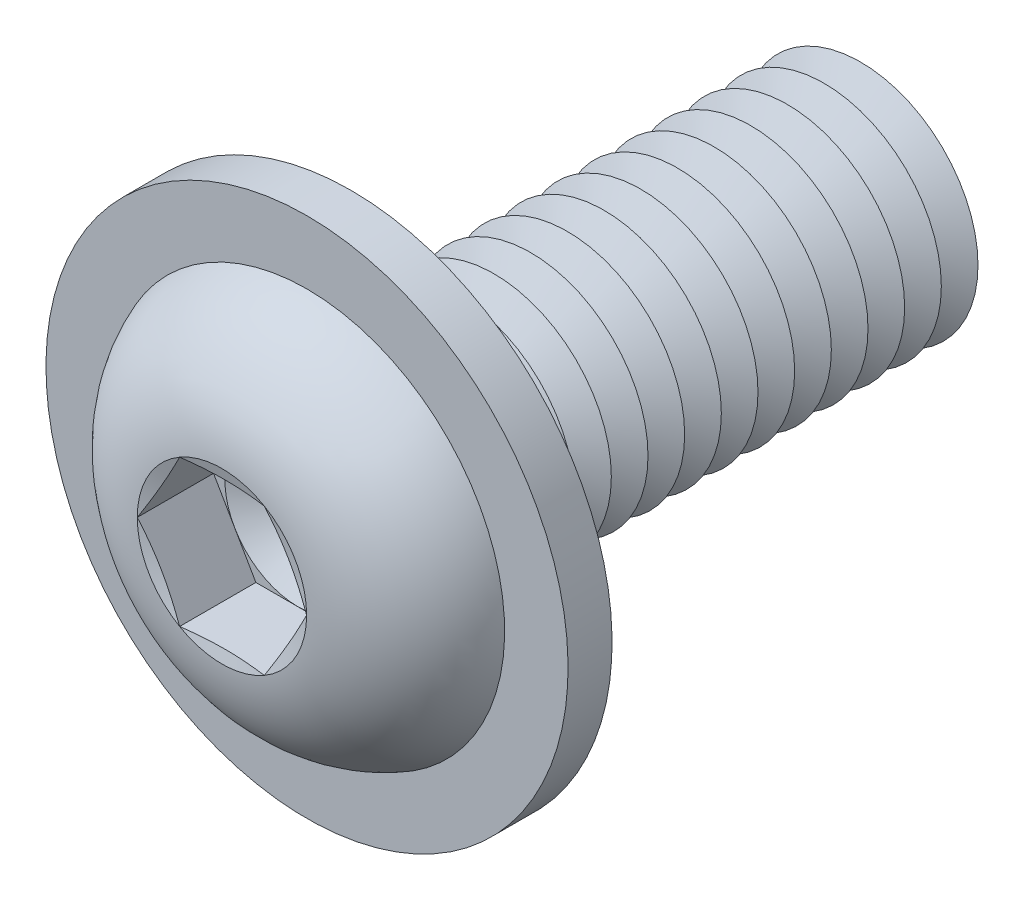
ISO-10303-21;
HEADER;
FILE_DESCRIPTION(('STEP AP214'),'2;1');
FILE_NAME('part.step','',(''),(''),'','','');
FILE_SCHEMA(('AUTOMOTIVE_DESIGN { 1 0 10303 214 1 1 1 1 }'));
ENDSEC;
DATA;
#1=APPLICATION_CONTEXT('core data for automotive mechanical design processes');
#2=APPLICATION_PROTOCOL_DEFINITION('international standard','automotive_design',2000,#1);
#3=PRODUCT_CONTEXT('',#1,'mechanical');
#4=PRODUCT('Part','Part','',(#3));
#5=PRODUCT_RELATED_PRODUCT_CATEGORY('part','',(#4));
#6=PRODUCT_DEFINITION_FORMATION('','',#4);
#7=PRODUCT_DEFINITION_CONTEXT('part definition',#1,'design');
#8=PRODUCT_DEFINITION('design','',#6,#7);
#9=PRODUCT_DEFINITION_SHAPE('','',#8);
#10=(LENGTH_UNIT() NAMED_UNIT(*) SI_UNIT(.MILLI.,.METRE.));
#11=(NAMED_UNIT(*) PLANE_ANGLE_UNIT() SI_UNIT($,.RADIAN.));
#12=(NAMED_UNIT(*) SI_UNIT($,.STERADIAN.) SOLID_ANGLE_UNIT());
#13=UNCERTAINTY_MEASURE_WITH_UNIT(LENGTH_MEASURE(1.E-05),#10,'distance_accuracy_value','');
#14=(GEOMETRIC_REPRESENTATION_CONTEXT(3) GLOBAL_UNCERTAINTY_ASSIGNED_CONTEXT((#13)) GLOBAL_UNIT_ASSIGNED_CONTEXT((#10,
#11,#12)) REPRESENTATION_CONTEXT('',''));
#15=CARTESIAN_POINT('',(0.,0.,0.));
#16=DIRECTION('',(0.,0.,1.));
#17=DIRECTION('',(1.,0.,0.));
#18=AXIS2_PLACEMENT_3D('',#15,#16,#17);
#19=CARTESIAN_POINT('',(0.,0.,-13.625));
#20=DIRECTION('',(0.,0.,1.));
#21=DIRECTION('',(1.,0.,0.));
#22=AXIS2_PLACEMENT_3D('',#19,#20,#21);
#23=CONICAL_SURFACE('',#22,4.00000000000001,1.0471975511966);
#24=CARTESIAN_POINT('',(0.,0.,-14.25));
#25=DIRECTION('',(0.,0.,1.));
#26=DIRECTION('',(1.,0.,0.));
#27=AXIS2_PLACEMENT_3D('',#24,#25,#26);
#28=CIRCLE('',#27,2.91746824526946);
#29=CARTESIAN_POINT('',(2.91746824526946,0.,-14.25));
#30=VERTEX_POINT('',#29);
#31=EDGE_CURVE('E322',#30,#30,#28,.T.);
#32=ORIENTED_EDGE('',*,*,#31,.T.);
#33=EDGE_LOOP('',(#32));
#34=FACE_BOUND('',#33,.T.);
#35=CARTESIAN_POINT('',(0.,0.,-13.625));
#36=DIRECTION('',(0.,0.,1.));
#37=DIRECTION('',(1.,0.,0.));
#38=AXIS2_PLACEMENT_3D('',#35,#36,#37);
#39=CIRCLE('',#38,4.00000000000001);
#40=CARTESIAN_POINT('',(4.00000000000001,0.,-13.625));
#41=VERTEX_POINT('',#40);
#42=EDGE_CURVE('E318',#41,#41,#39,.T.);
#43=ORIENTED_EDGE('',*,*,#42,.F.);
#44=EDGE_LOOP('',(#43));
#45=FACE_BOUND('',#44,.T.);
#46=ADVANCED_FACE('F39',(#34,#45),#23,.T.);
#47=CARTESIAN_POINT('',(0.,0.,-14.25));
#48=DIRECTION('',(0.,0.,-1.));
#49=DIRECTION('',(-1.,0.,0.));
#50=AXIS2_PLACEMENT_3D('',#47,#48,#49);
#51=CONICAL_SURFACE('',#50,2.91746824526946,1.0471975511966);
#52=CARTESIAN_POINT('',(0.,0.,-14.875));
#53=DIRECTION('',(0.,0.,1.));
#54=DIRECTION('',(1.,0.,0.));
#55=AXIS2_PLACEMENT_3D('',#52,#53,#54);
#56=CIRCLE('',#55,4.00000000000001);
#57=CARTESIAN_POINT('',(4.00000000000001,0.,-14.875));
#58=VERTEX_POINT('',#57);
#59=EDGE_CURVE('E326',#58,#58,#56,.T.);
#60=ORIENTED_EDGE('',*,*,#59,.T.);
#61=EDGE_LOOP('',(#60));
#62=FACE_BOUND('',#61,.T.);
#63=ORIENTED_EDGE('',*,*,#31,.F.);
#64=EDGE_LOOP('',(#63));
#65=FACE_BOUND('',#64,.T.);
#66=ADVANCED_FACE('F465',(#62,#65),#51,.T.);
#67=CARTESIAN_POINT('',(0.,4.00000000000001,-18.));
#68=DIRECTION('',(0.,0.,-1.));
#69=DIRECTION('',(-1.,0.,0.));
#70=AXIS2_PLACEMENT_3D('',#67,#68,#69);
#71=PLANE('',#70);
#72=CARTESIAN_POINT('',(0.,0.,-18.));
#73=DIRECTION('',(0.,0.,1.));
#74=DIRECTION('',(1.,0.,0.));
#75=AXIS2_PLACEMENT_3D('',#72,#73,#74);
#76=CIRCLE('',#75,2.91746824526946);
#77=CARTESIAN_POINT('',(2.91746824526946,0.,-18.));
#78=VERTEX_POINT('',#77);
#79=EDGE_CURVE('E345',#78,#78,#76,.T.);
#80=ORIENTED_EDGE('',*,*,#79,.F.);
#81=EDGE_LOOP('',(#80));
#82=FACE_BOUND('',#81,.T.);
#83=ADVANCED_FACE('F471',(#82),#71,.T.);
#84=CARTESIAN_POINT('',(0.,0.,-17.375));
#85=DIRECTION('',(0.,0.,1.));
#86=DIRECTION('',(1.,0.,0.));
#87=AXIS2_PLACEMENT_3D('',#84,#85,#86);
#88=CONICAL_SURFACE('',#87,4.00000000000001,1.0471975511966);
#89=ORIENTED_EDGE('',*,*,#79,.T.);
#90=EDGE_LOOP('',(#89));
#91=FACE_BOUND('',#90,.T.);
#92=CARTESIAN_POINT('',(0.,0.,-17.375));
#93=DIRECTION('',(0.,0.,1.));
#94=DIRECTION('',(1.,0.,0.));
#95=AXIS2_PLACEMENT_3D('',#92,#93,#94);
#96=CIRCLE('',#95,4.00000000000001);
#97=CARTESIAN_POINT('',(4.00000000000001,0.,-17.375));
#98=VERTEX_POINT('',#97);
#99=EDGE_CURVE('E341',#98,#98,#96,.T.);
#100=ORIENTED_EDGE('',*,*,#99,.F.);
#101=EDGE_LOOP('',(#100));
#102=FACE_BOUND('',#101,.T.);
#103=ADVANCED_FACE('F490',(#91,#102),#88,.T.);
#104=CARTESIAN_POINT('',(0.,0.,-16.75));
#105=DIRECTION('',(0.,0.,-1.));
#106=DIRECTION('',(-1.,0.,0.));
#107=AXIS2_PLACEMENT_3D('',#104,#105,#106);
#108=CONICAL_SURFACE('',#107,2.91746824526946,1.0471975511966);
#109=ORIENTED_EDGE('',*,*,#99,.T.);
#110=EDGE_LOOP('',(#109));
#111=FACE_BOUND('',#110,.T.);
#112=CARTESIAN_POINT('',(0.,0.,-16.75));
#113=DIRECTION('',(0.,0.,1.));
#114=DIRECTION('',(1.,0.,0.));
#115=AXIS2_PLACEMENT_3D('',#112,#113,#114);
#116=CIRCLE('',#115,2.91746824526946);
#117=CARTESIAN_POINT('',(2.91746824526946,0.,-16.75));
#118=VERTEX_POINT('',#117);
#119=EDGE_CURVE('E337',#118,#118,#116,.T.);
#120=ORIENTED_EDGE('',*,*,#119,.F.);
#121=EDGE_LOOP('',(#120));
#122=FACE_BOUND('',#121,.T.);
#123=ADVANCED_FACE('F487',(#111,#122),#108,.T.);
#124=CARTESIAN_POINT('',(0.,0.,-16.125));
#125=DIRECTION('',(0.,0.,1.));
#126=DIRECTION('',(1.,0.,0.));
#127=AXIS2_PLACEMENT_3D('',#124,#125,#126);
#128=CONICAL_SURFACE('',#127,4.00000000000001,1.0471975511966);
#129=ORIENTED_EDGE('',*,*,#119,.T.);
#130=EDGE_LOOP('',(#129));
#131=FACE_BOUND('',#130,.T.);
#132=CARTESIAN_POINT('',(0.,0.,-16.125));
#133=DIRECTION('',(0.,0.,1.));
#134=DIRECTION('',(1.,0.,0.));
#135=AXIS2_PLACEMENT_3D('',#132,#133,#134);
#136=CIRCLE('',#135,4.00000000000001);
#137=CARTESIAN_POINT('',(4.00000000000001,0.,-16.125));
#138=VERTEX_POINT('',#137);
#139=EDGE_CURVE('E333',#138,#138,#136,.T.);
#140=ORIENTED_EDGE('',*,*,#139,.F.);
#141=EDGE_LOOP('',(#140));
#142=FACE_BOUND('',#141,.T.);
#143=ADVANCED_FACE('F481',(#131,#142),#128,.T.);
#144=CARTESIAN_POINT('',(0.,0.,-15.5));
#145=DIRECTION('',(0.,0.,-1.));
#146=DIRECTION('',(-1.,0.,0.));
#147=AXIS2_PLACEMENT_3D('',#144,#145,#146);
#148=CONICAL_SURFACE('',#147,2.91746824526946,1.0471975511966);
#149=ORIENTED_EDGE('',*,*,#139,.T.);
#150=EDGE_LOOP('',(#149));
#151=FACE_BOUND('',#150,.T.);
#152=CARTESIAN_POINT('',(0.,0.,-15.5));
#153=DIRECTION('',(0.,0.,1.));
#154=DIRECTION('',(1.,0.,0.));
#155=AXIS2_PLACEMENT_3D('',#152,#153,#154);
#156=CIRCLE('',#155,2.91746824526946);
#157=CARTESIAN_POINT('',(2.91746824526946,0.,-15.5));
#158=VERTEX_POINT('',#157);
#159=EDGE_CURVE('E329',#158,#158,#156,.T.);
#160=ORIENTED_EDGE('',*,*,#159,.F.);
#161=EDGE_LOOP('',(#160));
#162=FACE_BOUND('',#161,.T.);
#163=ADVANCED_FACE('F477',(#151,#162),#148,.T.);
#164=CARTESIAN_POINT('',(0.,0.,-14.875));
#165=DIRECTION('',(0.,0.,1.));
#166=DIRECTION('',(1.,0.,0.));
#167=AXIS2_PLACEMENT_3D('',#164,#165,#166);
#168=CONICAL_SURFACE('',#167,4.00000000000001,1.0471975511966);
#169=ORIENTED_EDGE('',*,*,#159,.T.);
#170=EDGE_LOOP('',(#169));
#171=FACE_BOUND('',#170,.T.);
#172=ORIENTED_EDGE('',*,*,#59,.F.);
#173=EDGE_LOOP('',(#172));
#174=FACE_BOUND('',#173,.T.);
#175=ADVANCED_FACE('F480',(#171,#174),#168,.T.);
#176=CARTESIAN_POINT('',(0.,0.,-12.375));
#177=DIRECTION('',(0.,0.,1.));
#178=DIRECTION('',(1.,0.,0.));
#179=AXIS2_PLACEMENT_3D('',#176,#177,#178);
#180=CONICAL_SURFACE('',#179,4.00000000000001,1.0471975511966);
#181=CARTESIAN_POINT('',(0.,0.,-13.));
#182=DIRECTION('',(0.,0.,1.));
#183=DIRECTION('',(1.,0.,0.));
#184=AXIS2_PLACEMENT_3D('',#181,#182,#183);
#185=CIRCLE('',#184,2.91746824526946);
#186=CARTESIAN_POINT('',(2.91746824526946,0.,-13.));
#187=VERTEX_POINT('',#186);
#188=EDGE_CURVE('E314',#187,#187,#185,.T.);
#189=ORIENTED_EDGE('',*,*,#188,.T.);
#190=EDGE_LOOP('',(#189));
#191=FACE_BOUND('',#190,.T.);
#192=CARTESIAN_POINT('',(0.,0.,-12.375));
#193=DIRECTION('',(0.,0.,1.));
#194=DIRECTION('',(1.,0.,0.));
#195=AXIS2_PLACEMENT_3D('',#192,#193,#194);
#196=CIRCLE('',#195,4.00000000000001);
#197=CARTESIAN_POINT('',(4.00000000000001,0.,-12.375));
#198=VERTEX_POINT('',#197);
#199=EDGE_CURVE('E310',#198,#198,#196,.T.);
#200=ORIENTED_EDGE('',*,*,#199,.F.);
#201=EDGE_LOOP('',(#200));
#202=FACE_BOUND('',#201,.T.);
#203=ADVANCED_FACE('F485',(#191,#202),#180,.T.);
#204=CARTESIAN_POINT('',(0.,0.,-13.));
#205=DIRECTION('',(0.,0.,-1.));
#206=DIRECTION('',(-1.,0.,0.));
#207=AXIS2_PLACEMENT_3D('',#204,#205,#206);
#208=CONICAL_SURFACE('',#207,2.91746824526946,1.0471975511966);
#209=ORIENTED_EDGE('',*,*,#42,.T.);
#210=EDGE_LOOP('',(#209));
#211=FACE_BOUND('',#210,.T.);
#212=ORIENTED_EDGE('',*,*,#188,.F.);
#213=EDGE_LOOP('',(#212));
#214=FACE_BOUND('',#213,.T.);
#215=ADVANCED_FACE('F536',(#211,#214),#208,.T.);
#216=CARTESIAN_POINT('',(0.,0.,-11.125));
#217=DIRECTION('',(0.,0.,1.));
#218=DIRECTION('',(1.,0.,0.));
#219=AXIS2_PLACEMENT_3D('',#216,#217,#218);
#220=CONICAL_SURFACE('',#219,4.00000000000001,1.0471975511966);
#221=CARTESIAN_POINT('',(0.,0.,-11.75));
#222=DIRECTION('',(0.,0.,1.));
#223=DIRECTION('',(1.,0.,0.));
#224=AXIS2_PLACEMENT_3D('',#221,#222,#223);
#225=CIRCLE('',#224,2.91746824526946);
#226=CARTESIAN_POINT('',(2.91746824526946,0.,-11.75));
#227=VERTEX_POINT('',#226);
#228=EDGE_CURVE('E306',#227,#227,#225,.T.);
#229=ORIENTED_EDGE('',*,*,#228,.T.);
#230=EDGE_LOOP('',(#229));
#231=FACE_BOUND('',#230,.T.);
#232=CARTESIAN_POINT('',(0.,0.,-11.125));
#233=DIRECTION('',(0.,0.,1.));
#234=DIRECTION('',(1.,0.,0.));
#235=AXIS2_PLACEMENT_3D('',#232,#233,#234);
#236=CIRCLE('',#235,4.00000000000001);
#237=CARTESIAN_POINT('',(4.00000000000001,0.,-11.125));
#238=VERTEX_POINT('',#237);
#239=EDGE_CURVE('E302',#238,#238,#236,.T.);
#240=ORIENTED_EDGE('',*,*,#239,.F.);
#241=EDGE_LOOP('',(#240));
#242=FACE_BOUND('',#241,.T.);
#243=ADVANCED_FACE('F542',(#231,#242),#220,.T.);
#244=CARTESIAN_POINT('',(0.,0.,-11.75));
#245=DIRECTION('',(0.,0.,-1.));
#246=DIRECTION('',(-1.,0.,0.));
#247=AXIS2_PLACEMENT_3D('',#244,#245,#246);
#248=CONICAL_SURFACE('',#247,2.91746824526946,1.0471975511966);
#249=ORIENTED_EDGE('',*,*,#199,.T.);
#250=EDGE_LOOP('',(#249));
#251=FACE_BOUND('',#250,.T.);
#252=ORIENTED_EDGE('',*,*,#228,.F.);
#253=EDGE_LOOP('',(#252));
#254=FACE_BOUND('',#253,.T.);
#255=ADVANCED_FACE('F549',(#251,#254),#248,.T.);
#256=CARTESIAN_POINT('',(0.,0.,-9.875));
#257=DIRECTION('',(0.,0.,1.));
#258=DIRECTION('',(1.,0.,0.));
#259=AXIS2_PLACEMENT_3D('',#256,#257,#258);
#260=CONICAL_SURFACE('',#259,4.00000000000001,1.0471975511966);
#261=CARTESIAN_POINT('',(0.,0.,-10.5));
#262=DIRECTION('',(0.,0.,1.));
#263=DIRECTION('',(1.,0.,0.));
#264=AXIS2_PLACEMENT_3D('',#261,#262,#263);
#265=CIRCLE('',#264,2.91746824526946);
#266=CARTESIAN_POINT('',(2.91746824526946,0.,-10.5));
#267=VERTEX_POINT('',#266);
#268=EDGE_CURVE('E298',#267,#267,#265,.T.);
#269=ORIENTED_EDGE('',*,*,#268,.T.);
#270=EDGE_LOOP('',(#269));
#271=FACE_BOUND('',#270,.T.);
#272=CARTESIAN_POINT('',(0.,0.,-9.875));
#273=DIRECTION('',(0.,0.,1.));
#274=DIRECTION('',(1.,0.,0.));
#275=AXIS2_PLACEMENT_3D('',#272,#273,#274);
#276=CIRCLE('',#275,4.00000000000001);
#277=CARTESIAN_POINT('',(4.00000000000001,0.,-9.875));
#278=VERTEX_POINT('',#277);
#279=EDGE_CURVE('E294',#278,#278,#276,.T.);
#280=ORIENTED_EDGE('',*,*,#279,.F.);
#281=EDGE_LOOP('',(#280));
#282=FACE_BOUND('',#281,.T.);
#283=ADVANCED_FACE('F556',(#271,#282),#260,.T.);
#284=CARTESIAN_POINT('',(0.,0.,-10.5));
#285=DIRECTION('',(0.,0.,-1.));
#286=DIRECTION('',(-1.,0.,0.));
#287=AXIS2_PLACEMENT_3D('',#284,#285,#286);
#288=CONICAL_SURFACE('',#287,2.91746824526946,1.0471975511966);
#289=ORIENTED_EDGE('',*,*,#239,.T.);
#290=EDGE_LOOP('',(#289));
#291=FACE_BOUND('',#290,.T.);
#292=ORIENTED_EDGE('',*,*,#268,.F.);
#293=EDGE_LOOP('',(#292));
#294=FACE_BOUND('',#293,.T.);
#295=ADVANCED_FACE('F563',(#291,#294),#288,.T.);
#296=CARTESIAN_POINT('',(0.,0.,-8.625));
#297=DIRECTION('',(0.,0.,1.));
#298=DIRECTION('',(1.,0.,0.));
#299=AXIS2_PLACEMENT_3D('',#296,#297,#298);
#300=CONICAL_SURFACE('',#299,4.00000000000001,1.0471975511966);
#301=CARTESIAN_POINT('',(0.,0.,-9.25));
#302=DIRECTION('',(0.,0.,1.));
#303=DIRECTION('',(1.,0.,0.));
#304=AXIS2_PLACEMENT_3D('',#301,#302,#303);
#305=CIRCLE('',#304,2.91746824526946);
#306=CARTESIAN_POINT('',(2.91746824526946,0.,-9.25));
#307=VERTEX_POINT('',#306);
#308=EDGE_CURVE('E290',#307,#307,#305,.T.);
#309=ORIENTED_EDGE('',*,*,#308,.T.);
#310=EDGE_LOOP('',(#309));
#311=FACE_BOUND('',#310,.T.);
#312=CARTESIAN_POINT('',(0.,0.,-8.625));
#313=DIRECTION('',(0.,0.,1.));
#314=DIRECTION('',(1.,0.,0.));
#315=AXIS2_PLACEMENT_3D('',#312,#313,#314);
#316=CIRCLE('',#315,4.00000000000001);
#317=CARTESIAN_POINT('',(4.00000000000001,0.,-8.625));
#318=VERTEX_POINT('',#317);
#319=EDGE_CURVE('E286',#318,#318,#316,.T.);
#320=ORIENTED_EDGE('',*,*,#319,.F.);
#321=EDGE_LOOP('',(#320));
#322=FACE_BOUND('',#321,.T.);
#323=ADVANCED_FACE('F570',(#311,#322),#300,.T.);
#324=CARTESIAN_POINT('',(0.,0.,-9.25));
#325=DIRECTION('',(0.,0.,-1.));
#326=DIRECTION('',(-1.,0.,0.));
#327=AXIS2_PLACEMENT_3D('',#324,#325,#326);
#328=CONICAL_SURFACE('',#327,2.91746824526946,1.0471975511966);
#329=ORIENTED_EDGE('',*,*,#279,.T.);
#330=EDGE_LOOP('',(#329));
#331=FACE_BOUND('',#330,.T.);
#332=ORIENTED_EDGE('',*,*,#308,.F.);
#333=EDGE_LOOP('',(#332));
#334=FACE_BOUND('',#333,.T.);
#335=ADVANCED_FACE('F577',(#331,#334),#328,.T.);
#336=CARTESIAN_POINT('',(0.,0.,-7.375));
#337=DIRECTION('',(0.,0.,1.));
#338=DIRECTION('',(1.,0.,0.));
#339=AXIS2_PLACEMENT_3D('',#336,#337,#338);
#340=CONICAL_SURFACE('',#339,4.00000000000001,1.0471975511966);
#341=CARTESIAN_POINT('',(0.,0.,-8.));
#342=DIRECTION('',(0.,0.,1.));
#343=DIRECTION('',(1.,0.,0.));
#344=AXIS2_PLACEMENT_3D('',#341,#342,#343);
#345=CIRCLE('',#344,2.91746824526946);
#346=CARTESIAN_POINT('',(2.91746824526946,0.,-8.));
#347=VERTEX_POINT('',#346);
#348=EDGE_CURVE('E282',#347,#347,#345,.T.);
#349=ORIENTED_EDGE('',*,*,#348,.T.);
#350=EDGE_LOOP('',(#349));
#351=FACE_BOUND('',#350,.T.);
#352=CARTESIAN_POINT('',(0.,0.,-7.375));
#353=DIRECTION('',(0.,0.,1.));
#354=DIRECTION('',(1.,0.,0.));
#355=AXIS2_PLACEMENT_3D('',#352,#353,#354);
#356=CIRCLE('',#355,4.00000000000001);
#357=CARTESIAN_POINT('',(4.00000000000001,0.,-7.375));
#358=VERTEX_POINT('',#357);
#359=EDGE_CURVE('E278',#358,#358,#356,.T.);
#360=ORIENTED_EDGE('',*,*,#359,.F.);
#361=EDGE_LOOP('',(#360));
#362=FACE_BOUND('',#361,.T.);
#363=ADVANCED_FACE('F584',(#351,#362),#340,.T.);
#364=CARTESIAN_POINT('',(0.,0.,-8.));
#365=DIRECTION('',(0.,0.,-1.));
#366=DIRECTION('',(-1.,0.,0.));
#367=AXIS2_PLACEMENT_3D('',#364,#365,#366);
#368=CONICAL_SURFACE('',#367,2.91746824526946,1.0471975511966);
#369=ORIENTED_EDGE('',*,*,#319,.T.);
#370=EDGE_LOOP('',(#369));
#371=FACE_BOUND('',#370,.T.);
#372=ORIENTED_EDGE('',*,*,#348,.F.);
#373=EDGE_LOOP('',(#372));
#374=FACE_BOUND('',#373,.T.);
#375=ADVANCED_FACE('F591',(#371,#374),#368,.T.);
#376=CARTESIAN_POINT('',(0.,0.,-6.125));
#377=DIRECTION('',(0.,0.,1.));
#378=DIRECTION('',(1.,0.,0.));
#379=AXIS2_PLACEMENT_3D('',#376,#377,#378);
#380=CONICAL_SURFACE('',#379,4.00000000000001,1.0471975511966);
#381=CARTESIAN_POINT('',(0.,0.,-6.75));
#382=DIRECTION('',(0.,0.,1.));
#383=DIRECTION('',(1.,0.,0.));
#384=AXIS2_PLACEMENT_3D('',#381,#382,#383);
#385=CIRCLE('',#384,2.91746824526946);
#386=CARTESIAN_POINT('',(2.91746824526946,0.,-6.75));
#387=VERTEX_POINT('',#386);
#388=EDGE_CURVE('E274',#387,#387,#385,.T.);
#389=ORIENTED_EDGE('',*,*,#388,.T.);
#390=EDGE_LOOP('',(#389));
#391=FACE_BOUND('',#390,.T.);
#392=CARTESIAN_POINT('',(0.,0.,-6.125));
#393=DIRECTION('',(0.,0.,1.));
#394=DIRECTION('',(1.,0.,0.));
#395=AXIS2_PLACEMENT_3D('',#392,#393,#394);
#396=CIRCLE('',#395,4.00000000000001);
#397=CARTESIAN_POINT('',(4.00000000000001,0.,-6.125));
#398=VERTEX_POINT('',#397);
#399=EDGE_CURVE('E271',#398,#398,#396,.T.);
#400=ORIENTED_EDGE('',*,*,#399,.F.);
#401=EDGE_LOOP('',(#400));
#402=FACE_BOUND('',#401,.T.);
#403=ADVANCED_FACE('F598',(#391,#402),#380,.T.);
#404=CARTESIAN_POINT('',(0.,0.,-6.75));
#405=DIRECTION('',(0.,0.,-1.));
#406=DIRECTION('',(-1.,0.,0.));
#407=AXIS2_PLACEMENT_3D('',#404,#405,#406);
#408=CONICAL_SURFACE('',#407,2.91746824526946,1.0471975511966);
#409=ORIENTED_EDGE('',*,*,#359,.T.);
#410=EDGE_LOOP('',(#409));
#411=FACE_BOUND('',#410,.T.);
#412=ORIENTED_EDGE('',*,*,#388,.F.);
#413=EDGE_LOOP('',(#412));
#414=FACE_BOUND('',#413,.T.);
#415=ADVANCED_FACE('F605',(#411,#414),#408,.T.);
#416=CARTESIAN_POINT('',(0.,0.,-4.875));
#417=DIRECTION('',(0.,0.,1.));
#418=DIRECTION('',(1.,0.,0.));
#419=AXIS2_PLACEMENT_3D('',#416,#417,#418);
#420=CONICAL_SURFACE('',#419,4.00000000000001,1.0471975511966);
#421=CARTESIAN_POINT('',(0.,0.,-5.5));
#422=DIRECTION('',(0.,0.,1.));
#423=DIRECTION('',(1.,0.,0.));
#424=AXIS2_PLACEMENT_3D('',#421,#422,#423);
#425=CIRCLE('',#424,2.91746824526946);
#426=CARTESIAN_POINT('',(2.91746824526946,0.,-5.5));
#427=VERTEX_POINT('',#426);
#428=EDGE_CURVE('E267',#427,#427,#425,.T.);
#429=ORIENTED_EDGE('',*,*,#428,.T.);
#430=EDGE_LOOP('',(#429));
#431=FACE_BOUND('',#430,.T.);
#432=CARTESIAN_POINT('',(0.,0.,-4.875));
#433=DIRECTION('',(0.,0.,1.));
#434=DIRECTION('',(1.,0.,0.));
#435=AXIS2_PLACEMENT_3D('',#432,#433,#434);
#436=CIRCLE('',#435,4.00000000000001);
#437=CARTESIAN_POINT('',(4.00000000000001,0.,-4.875));
#438=VERTEX_POINT('',#437);
#439=EDGE_CURVE('E263',#438,#438,#436,.T.);
#440=ORIENTED_EDGE('',*,*,#439,.F.);
#441=EDGE_LOOP('',(#440));
#442=FACE_BOUND('',#441,.T.);
#443=ADVANCED_FACE('F612',(#431,#442),#420,.T.);
#444=CARTESIAN_POINT('',(0.,0.,-5.5));
#445=DIRECTION('',(0.,0.,-1.));
#446=DIRECTION('',(-1.,0.,0.));
#447=AXIS2_PLACEMENT_3D('',#444,#445,#446);
#448=CONICAL_SURFACE('',#447,2.91746824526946,1.0471975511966);
#449=ORIENTED_EDGE('',*,*,#399,.T.);
#450=EDGE_LOOP('',(#449));
#451=FACE_BOUND('',#450,.T.);
#452=ORIENTED_EDGE('',*,*,#428,.F.);
#453=EDGE_LOOP('',(#452));
#454=FACE_BOUND('',#453,.T.);
#455=ADVANCED_FACE('F619',(#451,#454),#448,.T.);
#456=CARTESIAN_POINT('',(0.,0.,-3.625));
#457=DIRECTION('',(0.,0.,1.));
#458=DIRECTION('',(1.,0.,0.));
#459=AXIS2_PLACEMENT_3D('',#456,#457,#458);
#460=CONICAL_SURFACE('',#459,4.00000000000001,1.0471975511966);
#461=CARTESIAN_POINT('',(0.,0.,-4.25));
#462=DIRECTION('',(0.,0.,1.));
#463=DIRECTION('',(1.,0.,0.));
#464=AXIS2_PLACEMENT_3D('',#461,#462,#463);
#465=CIRCLE('',#464,2.91746824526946);
#466=CARTESIAN_POINT('',(2.91746824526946,0.,-4.25));
#467=VERTEX_POINT('',#466);
#468=EDGE_CURVE('E259',#467,#467,#465,.T.);
#469=ORIENTED_EDGE('',*,*,#468,.T.);
#470=EDGE_LOOP('',(#469));
#471=FACE_BOUND('',#470,.T.);
#472=CARTESIAN_POINT('',(0.,0.,-3.625));
#473=DIRECTION('',(0.,0.,1.));
#474=DIRECTION('',(1.,0.,0.));
#475=AXIS2_PLACEMENT_3D('',#472,#473,#474);
#476=CIRCLE('',#475,4.00000000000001);
#477=CARTESIAN_POINT('',(4.00000000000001,0.,-3.625));
#478=VERTEX_POINT('',#477);
#479=EDGE_CURVE('E255',#478,#478,#476,.T.);
#480=ORIENTED_EDGE('',*,*,#479,.F.);
#481=EDGE_LOOP('',(#480));
#482=FACE_BOUND('',#481,.T.);
#483=ADVANCED_FACE('F626',(#471,#482),#460,.T.);
#484=CARTESIAN_POINT('',(0.,0.,-4.25));
#485=DIRECTION('',(0.,0.,-1.));
#486=DIRECTION('',(-1.,0.,0.));
#487=AXIS2_PLACEMENT_3D('',#484,#485,#486);
#488=CONICAL_SURFACE('',#487,2.91746824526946,1.0471975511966);
#489=ORIENTED_EDGE('',*,*,#439,.T.);
#490=EDGE_LOOP('',(#489));
#491=FACE_BOUND('',#490,.T.);
#492=ORIENTED_EDGE('',*,*,#468,.F.);
#493=EDGE_LOOP('',(#492));
#494=FACE_BOUND('',#493,.T.);
#495=ADVANCED_FACE('F633',(#491,#494),#488,.T.);
#496=CARTESIAN_POINT('',(0.,0.,-2.375));
#497=DIRECTION('',(0.,0.,1.));
#498=DIRECTION('',(1.,0.,0.));
#499=AXIS2_PLACEMENT_3D('',#496,#497,#498);
#500=CONICAL_SURFACE('',#499,4.00000000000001,1.0471975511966);
#501=CARTESIAN_POINT('',(0.,0.,-3.));
#502=DIRECTION('',(0.,0.,1.));
#503=DIRECTION('',(1.,0.,0.));
#504=AXIS2_PLACEMENT_3D('',#501,#502,#503);
#505=CIRCLE('',#504,2.91746824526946);
#506=CARTESIAN_POINT('',(2.91746824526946,0.,-3.));
#507=VERTEX_POINT('',#506);
#508=EDGE_CURVE('E251',#507,#507,#505,.T.);
#509=ORIENTED_EDGE('',*,*,#508,.T.);
#510=EDGE_LOOP('',(#509));
#511=FACE_BOUND('',#510,.T.);
#512=CARTESIAN_POINT('',(0.,0.,-2.375));
#513=DIRECTION('',(0.,0.,1.));
#514=DIRECTION('',(1.,0.,0.));
#515=AXIS2_PLACEMENT_3D('',#512,#513,#514);
#516=CIRCLE('',#515,4.00000000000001);
#517=CARTESIAN_POINT('',(4.00000000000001,0.,-2.375));
#518=VERTEX_POINT('',#517);
#519=EDGE_CURVE('E243',#518,#518,#516,.T.);
#520=ORIENTED_EDGE('',*,*,#519,.F.);
#521=EDGE_LOOP('',(#520));
#522=FACE_BOUND('',#521,.T.);
#523=ADVANCED_FACE('F640',(#511,#522),#500,.T.);
#524=CARTESIAN_POINT('',(0.,0.,-3.));
#525=DIRECTION('',(0.,0.,-1.));
#526=DIRECTION('',(-1.,0.,0.));
#527=AXIS2_PLACEMENT_3D('',#524,#525,#526);
#528=CONICAL_SURFACE('',#527,2.91746824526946,1.0471975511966);
#529=ORIENTED_EDGE('',*,*,#479,.T.);
#530=EDGE_LOOP('',(#529));
#531=FACE_BOUND('',#530,.T.);
#532=ORIENTED_EDGE('',*,*,#508,.F.);
#533=EDGE_LOOP('',(#532));
#534=FACE_BOUND('',#533,.T.);
#535=ADVANCED_FACE('F647',(#531,#534),#528,.T.);
#536=CARTESIAN_POINT('',(0.,0.,-1.125));
#537=DIRECTION('',(0.,0.,1.));
#538=DIRECTION('',(1.,0.,0.));
#539=AXIS2_PLACEMENT_3D('',#536,#537,#538);
#540=CONICAL_SURFACE('',#539,4.00000000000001,1.0471975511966);
#541=CARTESIAN_POINT('',(0.,0.,-1.75));
#542=DIRECTION('',(0.,0.,1.));
#543=DIRECTION('',(1.,0.,0.));
#544=AXIS2_PLACEMENT_3D('',#541,#542,#543);
#545=CIRCLE('',#544,2.91746824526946);
#546=CARTESIAN_POINT('',(2.91746824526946,0.,-1.75));
#547=VERTEX_POINT('',#546);
#548=EDGE_CURVE('E232',#547,#547,#545,.T.);
#549=ORIENTED_EDGE('',*,*,#548,.T.);
#550=EDGE_LOOP('',(#549));
#551=FACE_BOUND('',#550,.T.);
#552=CARTESIAN_POINT('',(0.,0.,-1.125));
#553=DIRECTION('',(0.,0.,1.));
#554=DIRECTION('',(1.,0.,0.));
#555=AXIS2_PLACEMENT_3D('',#552,#553,#554);
#556=CIRCLE('',#555,4.00000000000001);
#557=CARTESIAN_POINT('',(4.00000000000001,0.,-1.125));
#558=VERTEX_POINT('',#557);
#559=EDGE_CURVE('E247',#558,#558,#556,.T.);
#560=ORIENTED_EDGE('',*,*,#559,.F.);
#561=EDGE_LOOP('',(#560));
#562=FACE_BOUND('',#561,.T.);
#563=ADVANCED_FACE('F654',(#551,#562),#540,.T.);
#564=CARTESIAN_POINT('',(0.,0.,-1.75));
#565=DIRECTION('',(0.,0.,-1.));
#566=DIRECTION('',(-1.,0.,0.));
#567=AXIS2_PLACEMENT_3D('',#564,#565,#566);
#568=CONICAL_SURFACE('',#567,2.91746824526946,1.0471975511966);
#569=ORIENTED_EDGE('',*,*,#519,.T.);
#570=EDGE_LOOP('',(#569));
#571=FACE_BOUND('',#570,.T.);
#572=ORIENTED_EDGE('',*,*,#548,.F.);
#573=EDGE_LOOP('',(#572));
#574=FACE_BOUND('',#573,.T.);
#575=ADVANCED_FACE('F221',(#571,#574),#568,.T.);
#576=CARTESIAN_POINT('',(0.,4.,0.));
#577=DIRECTION('',(0.,0.,-1.));
#578=DIRECTION('',(-1.,0.,0.));
#579=AXIS2_PLACEMENT_3D('',#576,#577,#578);
#580=PLANE('',#579);
#581=CARTESIAN_POINT('',(0.,0.,0.));
#582=DIRECTION('',(0.,0.,-1.));
#583=DIRECTION('',(-1.,0.,0.));
#584=AXIS2_PLACEMENT_3D('',#581,#582,#583);
#585=CIRCLE('',#584,4.62500000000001);
#586=CARTESIAN_POINT('',(-4.62500000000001,0.,0.));
#587=VERTEX_POINT('',#586);
#588=EDGE_CURVE('E359',#587,#587,#585,.F.);
#589=ORIENTED_EDGE('',*,*,#588,.T.);
#590=EDGE_LOOP('',(#589));
#591=FACE_BOUND('',#590,.T.);
#592=CARTESIAN_POINT('',(0.,0.,0.));
#593=DIRECTION('',(0.,0.,-1.));
#594=DIRECTION('',(0.,1.,0.));
#595=AXIS2_PLACEMENT_3D('',#592,#593,#594);
#596=CIRCLE('',#595,8.9);
#597=CARTESIAN_POINT('',(0.,8.9,0.));
#598=VERTEX_POINT('',#597);
#599=EDGE_CURVE('E422',#598,#598,#596,.T.);
#600=ORIENTED_EDGE('',*,*,#599,.T.);
#601=EDGE_LOOP('',(#600));
#602=FACE_BOUND('',#601,.T.);
#603=ADVANCED_FACE('F666',(#591,#602),#580,.T.);
#604=CARTESIAN_POINT('',(0.,0.,-0.625000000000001));
#605=DIRECTION('',(0.,0.,-1.));
#606=DIRECTION('',(-1.,0.,0.));
#607=AXIS2_PLACEMENT_3D('',#604,#605,#606);
#608=TOROIDAL_SURFACE('',#607,4.62500000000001,0.625);
#609=ORIENTED_EDGE('',*,*,#588,.F.);
#610=EDGE_LOOP('',(#609));
#611=FACE_BOUND('',#610,.T.);
#612=CARTESIAN_POINT('',(0.,0.,-0.625000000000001));
#613=DIRECTION('',(0.,0.,-1.));
#614=DIRECTION('',(-1.,0.,0.));
#615=AXIS2_PLACEMENT_3D('',#612,#613,#614);
#616=CIRCLE('',#615,4.00000000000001);
#617=CARTESIAN_POINT('',(-4.00000000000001,0.,-0.625000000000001));
#618=VERTEX_POINT('',#617);
#619=EDGE_CURVE('E354',#618,#618,#616,.T.);
#620=ORIENTED_EDGE('',*,*,#619,.F.);
#621=EDGE_LOOP('',(#620));
#622=FACE_BOUND('',#621,.T.);
#623=ADVANCED_FACE('F41',(#611,#622),#608,.F.);
#624=CARTESIAN_POINT('',(0.,0.,-18.));
#625=DIRECTION('',(0.,0.,-1.));
#626=DIRECTION('',(-1.,0.,0.));
#627=AXIS2_PLACEMENT_3D('',#624,#625,#626);
#628=CYLINDRICAL_SURFACE('',#627,4.00000000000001);
#629=ORIENTED_EDGE('',*,*,#619,.T.);
#630=EDGE_LOOP('',(#629));
#631=FACE_BOUND('',#630,.T.);
#632=ORIENTED_EDGE('',*,*,#559,.T.);
#633=EDGE_LOOP('',(#632));
#634=FACE_BOUND('',#633,.T.);
#635=ADVANCED_FACE('F678',(#631,#634),#628,.T.);
#636=CARTESIAN_POINT('',(0.,0.,1.5));
#637=DIRECTION('',(0.,0.,-1.));
#638=DIRECTION('',(0.,1.,0.));
#639=AXIS2_PLACEMENT_3D('',#636,#637,#638);
#640=CYLINDRICAL_SURFACE('',#639,8.9);
#641=CARTESIAN_POINT('',(0.,0.,1.5));
#642=DIRECTION('',(0.,0.,-1.));
#643=DIRECTION('',(0.,1.,0.));
#644=AXIS2_PLACEMENT_3D('',#641,#642,#643);
#645=CIRCLE('',#644,8.9);
#646=CARTESIAN_POINT('',(0.,8.9,1.5));
#647=VERTEX_POINT('',#646);
#648=EDGE_CURVE('E420',#647,#647,#645,.T.);
#649=ORIENTED_EDGE('',*,*,#648,.T.);
#650=EDGE_LOOP('',(#649));
#651=FACE_BOUND('',#650,.T.);
#652=ORIENTED_EDGE('',*,*,#599,.F.);
#653=EDGE_LOOP('',(#652));
#654=FACE_BOUND('',#653,.T.);
#655=ADVANCED_FACE('F684',(#651,#654),#640,.T.);
#656=CARTESIAN_POINT('',(0.,0.,1.5));
#657=DIRECTION('',(0.,0.,-1.));
#658=DIRECTION('',(0.,1.,0.));
#659=AXIS2_PLACEMENT_3D('',#656,#657,#658);
#660=PLANE('',#659);
#661=CARTESIAN_POINT('',(0.,0.,1.5));
#662=DIRECTION('',(0.,0.,-1.));
#663=DIRECTION('',(0.,1.,0.));
#664=AXIS2_PLACEMENT_3D('',#661,#662,#663);
#665=CIRCLE('',#664,6.73705889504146);
#666=CARTESIAN_POINT('',(0.,6.73705889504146,1.5));
#667=VERTEX_POINT('',#666);
#668=EDGE_CURVE('E43',#667,#667,#665,.F.);
#669=ORIENTED_EDGE('',*,*,#668,.F.);
#670=EDGE_LOOP('',(#669));
#671=FACE_BOUND('',#670,.T.);
#672=ORIENTED_EDGE('',*,*,#648,.F.);
#673=EDGE_LOOP('',(#672));
#674=FACE_BOUND('',#673,.T.);
#675=ADVANCED_FACE('F117',(#671,#674),#660,.F.);
#676=CARTESIAN_POINT('',(0.,0.,1.8));
#677=DIRECTION('',(0.,0.,1.));
#678=DIRECTION('',(1.,0.,0.));
#679=AXIS2_PLACEMENT_3D('',#676,#677,#678);
#680=CONICAL_SURFACE('',#679,2.49999883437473,1.0471975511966);
#681=CARTESIAN_POINT('',(0.,0.,0.35662500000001));
#682=VERTEX_POINT('',#681);
#683=VERTEX_LOOP('',#682);
#684=FACE_BOUND('',#683,.T.);
#685=CARTESIAN_POINT('',(0.,0.,1.8));
#686=DIRECTION('',(0.,0.,1.));
#687=DIRECTION('',(1.,0.,0.));
#688=AXIS2_PLACEMENT_3D('',#685,#686,#687);
#689=CIRCLE('',#688,2.49999883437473);
#690=CARTESIAN_POINT('',(2.1650625,1.24999941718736,1.8));
#691=VERTEX_POINT('',#690);
#692=CARTESIAN_POINT('',(0.,2.49999883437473,1.8));
#693=VERTEX_POINT('',#692);
#694=EDGE_CURVE('E120',#691,#693,#689,.T.);
#695=ORIENTED_EDGE('',*,*,#694,.T.);
#696=CARTESIAN_POINT('',(0.,0.,1.8));
#697=DIRECTION('',(0.,0.,1.));
#698=DIRECTION('',(1.,0.,0.));
#699=AXIS2_PLACEMENT_3D('',#696,#697,#698);
#700=CIRCLE('',#699,2.49999883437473);
#701=CARTESIAN_POINT('',(-2.1650625,1.24999941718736,1.8));
#702=VERTEX_POINT('',#701);
#703=EDGE_CURVE('E11',#693,#702,#700,.T.);
#704=ORIENTED_EDGE('',*,*,#703,.T.);
#705=CARTESIAN_POINT('',(-2.1650625,-1.24999941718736,1.8));
#706=VERTEX_POINT('',#705);
#707=EDGE_CURVE('E49',#702,#706,#700,.T.);
#708=ORIENTED_EDGE('',*,*,#707,.T.);
#709=CARTESIAN_POINT('',(0.,-2.49999883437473,1.8));
#710=VERTEX_POINT('',#709);
#711=EDGE_CURVE('E365',#706,#710,#700,.T.);
#712=ORIENTED_EDGE('',*,*,#711,.T.);
#713=CARTESIAN_POINT('',(2.1650625,-1.24999941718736,1.8));
#714=VERTEX_POINT('',#713);
#715=EDGE_CURVE('E57',#710,#714,#700,.T.);
#716=ORIENTED_EDGE('',*,*,#715,.T.);
#717=EDGE_CURVE('E50',#714,#691,#700,.T.);
#718=ORIENTED_EDGE('',*,*,#717,.T.);
#719=EDGE_LOOP('',(#695,#704,#708,#712,#716,#718));
#720=FACE_BOUND('',#719,.T.);
#721=ADVANCED_FACE('F114',(#684,#720),#680,.F.);
#722=CARTESIAN_POINT('',(0.,0.,1.8));
#723=DIRECTION('',(0.,0.,1.));
#724=DIRECTION('',(1.,0.,0.));
#725=AXIS2_PLACEMENT_3D('',#722,#723,#724);
#726=PLANE('',#725);
#727=ORIENTED_EDGE('',*,*,#711,.F.);
#728=DIRECTION('',(0.5,-0.866025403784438,0.));
#729=VECTOR('',#728,1.);
#730=CARTESIAN_POINT('',(-2.88675,0.,1.8));
#731=LINE('',#730,#729);
#732=CARTESIAN_POINT('',(-1.443375,-2.49999883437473,1.8));
#733=VERTEX_POINT('',#732);
#734=EDGE_CURVE('E154',#706,#733,#731,.T.);
#735=ORIENTED_EDGE('',*,*,#734,.T.);
#736=DIRECTION('',(1.,0.,0.));
#737=VECTOR('',#736,1.);
#738=CARTESIAN_POINT('',(-1.443375,-2.49999883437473,1.8));
#739=LINE('',#738,#737);
#740=EDGE_CURVE('E160',#733,#710,#739,.T.);
#741=ORIENTED_EDGE('',*,*,#740,.T.);
#742=EDGE_LOOP('',(#727,#735,#741));
#743=FACE_BOUND('',#742,.T.);
#744=ADVANCED_FACE('F116',(#743),#726,.T.);
#745=ORIENTED_EDGE('',*,*,#715,.F.);
#746=CARTESIAN_POINT('',(1.443375,-2.49999883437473,1.8));
#747=VERTEX_POINT('',#746);
#748=EDGE_CURVE('E159',#710,#747,#739,.T.);
#749=ORIENTED_EDGE('',*,*,#748,.T.);
#750=DIRECTION('',(0.5,0.866025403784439,0.));
#751=VECTOR('',#750,1.);
#752=CARTESIAN_POINT('',(1.443375,-2.49999883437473,1.8));
#753=LINE('',#752,#751);
#754=EDGE_CURVE('E165',#747,#714,#753,.T.);
#755=ORIENTED_EDGE('',*,*,#754,.T.);
#756=EDGE_LOOP('',(#745,#749,#755));
#757=FACE_BOUND('',#756,.T.);
#758=ADVANCED_FACE('F705',(#757),#726,.T.);
#759=ORIENTED_EDGE('',*,*,#717,.F.);
#760=CARTESIAN_POINT('',(2.88675,0.,1.8));
#761=VERTEX_POINT('',#760);
#762=EDGE_CURVE('E164',#714,#761,#753,.T.);
#763=ORIENTED_EDGE('',*,*,#762,.T.);
#764=DIRECTION('',(-0.5,0.866025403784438,0.));
#765=VECTOR('',#764,1.);
#766=CARTESIAN_POINT('',(2.88675,0.,1.8));
#767=LINE('',#766,#765);
#768=EDGE_CURVE('E142',#761,#691,#767,.T.);
#769=ORIENTED_EDGE('',*,*,#768,.T.);
#770=EDGE_LOOP('',(#759,#763,#769));
#771=FACE_BOUND('',#770,.T.);
#772=ADVANCED_FACE('F429',(#771),#726,.T.);
#773=ORIENTED_EDGE('',*,*,#694,.F.);
#774=CARTESIAN_POINT('',(1.443375,2.49999883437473,1.8));
#775=VERTEX_POINT('',#774);
#776=EDGE_CURVE('E127',#691,#775,#767,.T.);
#777=ORIENTED_EDGE('',*,*,#776,.T.);
#778=DIRECTION('',(-1.,0.,0.));
#779=VECTOR('',#778,1.);
#780=CARTESIAN_POINT('',(1.443375,2.49999883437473,1.8));
#781=LINE('',#780,#779);
#782=EDGE_CURVE('E138',#775,#693,#781,.T.);
#783=ORIENTED_EDGE('',*,*,#782,.T.);
#784=EDGE_LOOP('',(#773,#777,#783));
#785=FACE_BOUND('',#784,.T.);
#786=ADVANCED_FACE('F144',(#785),#726,.T.);
#787=ORIENTED_EDGE('',*,*,#703,.F.);
#788=CARTESIAN_POINT('',(-1.443375,2.49999883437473,1.8));
#789=VERTEX_POINT('',#788);
#790=EDGE_CURVE('E133',#693,#789,#781,.T.);
#791=ORIENTED_EDGE('',*,*,#790,.T.);
#792=DIRECTION('',(-0.5,-0.866025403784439,0.));
#793=VECTOR('',#792,1.);
#794=CARTESIAN_POINT('',(-1.443375,2.49999883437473,1.8));
#795=LINE('',#794,#793);
#796=EDGE_CURVE('E136',#789,#702,#795,.T.);
#797=ORIENTED_EDGE('',*,*,#796,.T.);
#798=EDGE_LOOP('',(#787,#791,#797));
#799=FACE_BOUND('',#798,.T.);
#800=ADVANCED_FACE('F132',(#799),#726,.T.);
#801=ORIENTED_EDGE('',*,*,#707,.F.);
#802=CARTESIAN_POINT('',(-2.88675,0.,1.8));
#803=VERTEX_POINT('',#802);
#804=EDGE_CURVE('E146',#702,#803,#795,.T.);
#805=ORIENTED_EDGE('',*,*,#804,.T.);
#806=EDGE_CURVE('E155',#803,#706,#731,.T.);
#807=ORIENTED_EDGE('',*,*,#806,.T.);
#808=EDGE_LOOP('',(#801,#805,#807));
#809=FACE_BOUND('',#808,.T.);
#810=ADVANCED_FACE('F382',(#809),#726,.T.);
#811=CARTESIAN_POINT('',(-2.88675,0.,1.8));
#812=DIRECTION('',(-0.866025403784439,-0.5,0.));
#813=DIRECTION('',(0.5,-0.866025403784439,0.));
#814=AXIS2_PLACEMENT_3D('',#811,#812,#813);
#815=PLANE('',#814);
#816=CARTESIAN_POINT('',(-2.88686547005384,0.000200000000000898,4.40003094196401));
#817=CARTESIAN_POINT('',(-2.82691617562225,-0.103635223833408,4.3839595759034));
#818=CARTESIAN_POINT('',(-2.76685817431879,-0.207658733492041,4.36936933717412));
#819=CARTESIAN_POINT('',(-2.64653003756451,-0.416073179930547,4.3437355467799));
#820=CARTESIAN_POINT('',(-2.58625982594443,-0.520464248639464,4.33269343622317));
#821=CARTESIAN_POINT('',(-2.46587274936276,-0.728980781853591,4.31480063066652));
#822=CARTESIAN_POINT('',(-2.40575669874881,-0.833104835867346,4.3079285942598));
#823=CARTESIAN_POINT('',(-2.28544792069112,-1.0414857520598,4.29871388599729));
#824=CARTESIAN_POINT('',(-2.22525521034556,-1.14574258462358,4.29637033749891));
#825=CARTESIAN_POINT('',(-2.10486978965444,-1.35425624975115,4.29637033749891));
#826=CARTESIAN_POINT('',(-2.04467707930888,-1.45851308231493,4.29871388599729));
#827=CARTESIAN_POINT('',(-1.92436830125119,-1.66689399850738,4.3079285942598));
#828=CARTESIAN_POINT('',(-1.86425225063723,-1.77101805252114,4.31480063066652));
#829=CARTESIAN_POINT('',(-1.74386517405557,-1.97953458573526,4.33269343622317));
#830=CARTESIAN_POINT('',(-1.68359496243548,-2.08392565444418,4.3437355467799));
#831=CARTESIAN_POINT('',(-1.56326682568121,-2.29234010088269,4.36936933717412));
#832=CARTESIAN_POINT('',(-1.50320882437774,-2.39636361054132,4.3839595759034));
#833=CARTESIAN_POINT('',(-1.44325952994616,-2.50019883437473,4.40003094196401));
#834=B_SPLINE_CURVE_WITH_KNOTS('',3,(#816,#817,#818,#819,#820,#821,#822,#823,#824,#825,#826,
#827,#828,#829,#830,#831,#832,#833),.UNSPECIFIED.,.F.,.F.,(4,2,2,2,2,2,2,2,4),(0.,
0.362931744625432,0.726010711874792,1.08721550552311,1.44835036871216,1.8094852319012,
2.17069002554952,2.53376899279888,2.89670073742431),.UNSPECIFIED.);
#835=CARTESIAN_POINT('',(-2.88675,0.,4.4));
#836=VERTEX_POINT('',#835);
#837=CARTESIAN_POINT('',(-1.443375,-2.49999883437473,4.4));
#838=VERTEX_POINT('',#837);
#839=EDGE_CURVE('E387',#836,#838,#834,.T.);
#840=ORIENTED_EDGE('',*,*,#839,.T.);
#841=DIRECTION('',(0.,0.,1.));
#842=VECTOR('',#841,1.);
#843=CARTESIAN_POINT('',(-1.443375,-2.49999883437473,1.8));
#844=LINE('',#843,#842);
#845=EDGE_CURVE('E178',#733,#838,#844,.T.);
#846=ORIENTED_EDGE('',*,*,#845,.F.);
#847=ORIENTED_EDGE('',*,*,#734,.F.);
#848=ORIENTED_EDGE('',*,*,#806,.F.);
#849=DIRECTION('',(0.,0.,1.));
#850=VECTOR('',#849,1.);
#851=CARTESIAN_POINT('',(-2.88675,0.,1.8));
#852=LINE('',#851,#850);
#853=EDGE_CURVE('E182',#803,#836,#852,.T.);
#854=ORIENTED_EDGE('',*,*,#853,.T.);
#855=EDGE_LOOP('',(#840,#846,#847,#848,#854));
#856=FACE_BOUND('',#855,.T.);
#857=ADVANCED_FACE('F380',(#856),#815,.F.);
#858=CARTESIAN_POINT('',(-1.443375,-2.49999883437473,1.8));
#859=DIRECTION('',(0.,-1.,0.));
#860=DIRECTION('',(1.,0.,0.));
#861=AXIS2_PLACEMENT_3D('',#858,#859,#860);
#862=PLANE('',#861);
#863=CARTESIAN_POINT('',(-4.35611719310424,-2.49999883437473,4.97227902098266));
#864=CARTESIAN_POINT('',(-4.25066509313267,-2.49999883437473,4.94777440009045));
#865=CARTESIAN_POINT('',(-4.14516541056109,-2.49999883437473,4.92347459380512));
#866=CARTESIAN_POINT('',(-3.93405094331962,-2.49999883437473,4.87537247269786));
#867=CARTESIAN_POINT('',(-3.82843615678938,-2.49999883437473,4.85157016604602));
#868=CARTESIAN_POINT('',(-3.5113534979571,-2.49999883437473,4.78103338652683));
#869=CARTESIAN_POINT('',(-3.29968815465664,-2.49999883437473,4.73517861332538));
#870=CARTESIAN_POINT('',(-2.87365524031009,-2.49999883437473,4.64645582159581));
#871=CARTESIAN_POINT('',(-2.65928093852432,-2.49999883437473,4.60361983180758));
#872=CARTESIAN_POINT('',(-2.22952626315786,-2.49999883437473,4.52311285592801));
#873=CARTESIAN_POINT('',(-2.01414580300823,-2.49999883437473,4.48544232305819));
#874=CARTESIAN_POINT('',(-1.58798319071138,-2.49999883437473,4.41876559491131));
#875=CARTESIAN_POINT('',(-1.37723418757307,-2.49999883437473,4.38955265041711));
#876=CARTESIAN_POINT('',(-0.954530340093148,-2.49999883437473,4.34171384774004));
#877=CARTESIAN_POINT('',(-0.742575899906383,-2.49999883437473,4.32308463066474));
#878=CARTESIAN_POINT('',(-0.424544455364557,-2.49999883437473,4.30539140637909));
#879=CARTESIAN_POINT('',(-0.318745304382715,-2.49999883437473,4.30120018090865));
#880=CARTESIAN_POINT('',(-0.107062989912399,-2.49999883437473,4.29638997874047));
#881=CARTESIAN_POINT('',(-0.00117982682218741,-2.49999883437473,4.29577098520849));
#882=CARTESIAN_POINT('',(0.210552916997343,-2.49999883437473,4.29814378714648));
#883=CARTESIAN_POINT('',(0.316402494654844,-2.49999883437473,4.30113585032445));
#884=CARTESIAN_POINT('',(0.527944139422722,-2.49999883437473,4.31057322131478));
#885=CARTESIAN_POINT('',(0.633636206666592,-2.49999883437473,4.31701852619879));
#886=CARTESIAN_POINT('',(0.890304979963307,-2.49999883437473,4.33652018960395));
#887=CARTESIAN_POINT('',(1.0411561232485,-2.49999883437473,4.35122885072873));
#888=CARTESIAN_POINT('',(1.34222474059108,-2.49999883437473,4.38593609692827));
#889=CARTESIAN_POINT('',(1.49244223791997,-2.49999883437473,4.40593448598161));
#890=CARTESIAN_POINT('',(1.79273634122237,-2.49999883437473,4.45011321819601));
#891=CARTESIAN_POINT('',(1.94281100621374,-2.49999883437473,4.47430656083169));
#892=CARTESIAN_POINT('',(2.24242097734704,-2.49999883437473,4.52583552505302));
#893=CARTESIAN_POINT('',(2.39195625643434,-2.49999883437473,4.55317130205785));
#894=CARTESIAN_POINT('',(2.69364402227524,-2.49999883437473,4.61079781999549));
#895=CARTESIAN_POINT('',(2.8457870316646,-2.49999883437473,4.64113779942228));
#896=CARTESIAN_POINT('',(3.14969016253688,-2.49999883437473,4.70367638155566));
#897=CARTESIAN_POINT('',(3.30145027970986,-2.49999883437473,4.73587500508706));
#898=CARTESIAN_POINT('',(3.60383766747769,-2.49999883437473,4.80150275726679));
#899=CARTESIAN_POINT('',(3.75446660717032,-2.49999883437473,4.83492423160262));
#900=CARTESIAN_POINT('',(4.05546753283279,-2.49999883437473,4.90285814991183));
#901=CARTESIAN_POINT('',(4.2058395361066,-2.49999883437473,4.9373705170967));
#902=CARTESIAN_POINT('',(4.35611719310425,-2.49999883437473,4.97227902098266));
#903=B_SPLINE_CURVE_WITH_KNOTS('',3,(#863,#864,#865,#866,#867,#868,#869,#870,#871,#872,#873,
#874,#875,#876,#877,#878,#879,#880,#881,#882,#883,#884,#885,#886,#887,#888,#889,#890,#891,#892,
#893,#894,#895,#896,#897,#898,#899,#900,#901,#902),.UNSPECIFIED.,.F.,.F.,(4,2,2,2,2,2,2,2,2,2,2,
2,2,2,2,2,2,2,2,4),(0.,0.324785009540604,0.6495753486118,1.29928181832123,1.95507889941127,
2.61093348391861,3.24905289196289,3.88696967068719,4.204563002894,4.5221548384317,
4.83977022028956,5.15738533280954,5.61196030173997,6.06651842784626,6.52251118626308,
6.97852650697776,7.44392737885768,7.90933346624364,8.37220553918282,8.83504510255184),.UNSPECIFIED.);
#904=CARTESIAN_POINT('',(1.443375,-2.49999883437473,4.4));
#905=VERTEX_POINT('',#904);
#906=EDGE_CURVE('E394',#838,#905,#903,.T.);
#907=ORIENTED_EDGE('',*,*,#906,.T.);
#908=DIRECTION('',(0.,0.,1.));
#909=VECTOR('',#908,1.);
#910=CARTESIAN_POINT('',(1.443375,-2.49999883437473,1.8));
#911=LINE('',#910,#909);
#912=EDGE_CURVE('E174',#747,#905,#911,.T.);
#913=ORIENTED_EDGE('',*,*,#912,.F.);
#914=ORIENTED_EDGE('',*,*,#748,.F.);
#915=ORIENTED_EDGE('',*,*,#740,.F.);
#916=ORIENTED_EDGE('',*,*,#845,.T.);
#917=EDGE_LOOP('',(#907,#913,#914,#915,#916));
#918=FACE_BOUND('',#917,.T.);
#919=ADVANCED_FACE('F454',(#918),#862,.F.);
#920=CARTESIAN_POINT('',(1.443375,-2.49999883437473,1.8));
#921=DIRECTION('',(0.866025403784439,-0.5,0.));
#922=DIRECTION('',(0.5,0.866025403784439,0.));
#923=AXIS2_PLACEMENT_3D('',#920,#921,#922);
#924=PLANE('',#923);
#925=CARTESIAN_POINT('',(1.44325952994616,-2.50019883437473,4.40003094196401));
#926=CARTESIAN_POINT('',(1.50320882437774,-2.39636361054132,4.3839595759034));
#927=CARTESIAN_POINT('',(1.56326682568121,-2.29234010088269,4.36936933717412));
#928=CARTESIAN_POINT('',(1.68359496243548,-2.08392565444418,4.3437355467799));
#929=CARTESIAN_POINT('',(1.74386517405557,-1.97953458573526,4.33269343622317));
#930=CARTESIAN_POINT('',(1.86425225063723,-1.77101805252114,4.31480063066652));
#931=CARTESIAN_POINT('',(1.92436830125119,-1.66689399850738,4.3079285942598));
#932=CARTESIAN_POINT('',(2.04467707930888,-1.45851308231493,4.29871388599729));
#933=CARTESIAN_POINT('',(2.10486978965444,-1.35425624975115,4.29637033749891));
#934=CARTESIAN_POINT('',(2.22525521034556,-1.14574258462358,4.29637033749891));
#935=CARTESIAN_POINT('',(2.28544792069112,-1.0414857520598,4.29871388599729));
#936=CARTESIAN_POINT('',(2.40575669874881,-0.833104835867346,4.3079285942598));
#937=CARTESIAN_POINT('',(2.46587274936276,-0.728980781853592,4.31480063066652));
#938=CARTESIAN_POINT('',(2.58625982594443,-0.520464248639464,4.33269343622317));
#939=CARTESIAN_POINT('',(2.64653003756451,-0.416073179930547,4.3437355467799));
#940=CARTESIAN_POINT('',(2.76685817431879,-0.207658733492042,4.36936933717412));
#941=CARTESIAN_POINT('',(2.82691617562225,-0.103635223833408,4.3839595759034));
#942=CARTESIAN_POINT('',(2.88686547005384,0.000200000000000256,4.40003094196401));
#943=B_SPLINE_CURVE_WITH_KNOTS('',3,(#925,#926,#927,#928,#929,#930,#931,#932,#933,#934,#935,
#936,#937,#938,#939,#940,#941,#942),.UNSPECIFIED.,.F.,.F.,(4,2,2,2,2,2,2,2,4),(0.,
0.362931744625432,0.726010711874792,1.08721550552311,1.44835036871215,1.80948523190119,
2.17069002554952,2.53376899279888,2.89670073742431),.UNSPECIFIED.);
#944=CARTESIAN_POINT('',(2.88675,0.,4.4));
#945=VERTEX_POINT('',#944);
#946=EDGE_CURVE('E233',#905,#945,#943,.T.);
#947=ORIENTED_EDGE('',*,*,#946,.T.);
#948=DIRECTION('',(0.,0.,1.));
#949=VECTOR('',#948,1.);
#950=CARTESIAN_POINT('',(2.88675,0.,1.8));
#951=LINE('',#950,#949);
#952=EDGE_CURVE('E169',#761,#945,#951,.T.);
#953=ORIENTED_EDGE('',*,*,#952,.F.);
#954=ORIENTED_EDGE('',*,*,#762,.F.);
#955=ORIENTED_EDGE('',*,*,#754,.F.);
#956=ORIENTED_EDGE('',*,*,#912,.T.);
#957=EDGE_LOOP('',(#947,#953,#954,#955,#956));
#958=FACE_BOUND('',#957,.T.);
#959=ADVANCED_FACE('F219',(#958),#924,.F.);
#960=CARTESIAN_POINT('',(2.88675,0.,1.8));
#961=DIRECTION('',(0.866025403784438,0.5,0.));
#962=DIRECTION('',(-0.5,0.866025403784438,0.));
#963=AXIS2_PLACEMENT_3D('',#960,#961,#962);
#964=PLANE('',#963);
#965=CARTESIAN_POINT('',(2.88686547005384,-0.000199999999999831,4.40003094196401));
#966=CARTESIAN_POINT('',(2.82691617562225,0.103635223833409,4.3839595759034));
#967=CARTESIAN_POINT('',(2.76685817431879,0.207658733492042,4.36936933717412));
#968=CARTESIAN_POINT('',(2.64653003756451,0.416073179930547,4.3437355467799));
#969=CARTESIAN_POINT('',(2.58625982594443,0.520464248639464,4.33269343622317));
#970=CARTESIAN_POINT('',(2.46587274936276,0.728980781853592,4.31480063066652));
#971=CARTESIAN_POINT('',(2.40575669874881,0.833104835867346,4.3079285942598));
#972=CARTESIAN_POINT('',(2.28544792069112,1.0414857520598,4.29871388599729));
#973=CARTESIAN_POINT('',(2.22525521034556,1.14574258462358,4.29637033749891));
#974=CARTESIAN_POINT('',(2.10486978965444,1.35425624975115,4.29637033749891));
#975=CARTESIAN_POINT('',(2.04467707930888,1.45851308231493,4.29871388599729));
#976=CARTESIAN_POINT('',(1.92436830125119,1.66689399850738,4.3079285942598));
#977=CARTESIAN_POINT('',(1.86425225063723,1.77101805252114,4.31480063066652));
#978=CARTESIAN_POINT('',(1.74386517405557,1.97953458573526,4.33269343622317));
#979=CARTESIAN_POINT('',(1.68359496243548,2.08392565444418,4.3437355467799));
#980=CARTESIAN_POINT('',(1.56326682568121,2.29234010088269,4.36936933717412));
#981=CARTESIAN_POINT('',(1.50320882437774,2.39636361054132,4.3839595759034));
#982=CARTESIAN_POINT('',(1.44325952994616,2.50019883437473,4.40003094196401));
#983=B_SPLINE_CURVE_WITH_KNOTS('',3,(#965,#966,#967,#968,#969,#970,#971,#972,#973,#974,#975,
#976,#977,#978,#979,#980,#981,#982),.UNSPECIFIED.,.F.,.F.,(4,2,2,2,2,2,2,2,4),(0.,
0.362931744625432,0.726010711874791,1.08721550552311,1.44835036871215,1.80948523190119,
2.17069002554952,2.53376899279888,2.89670073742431),.UNSPECIFIED.);
#984=CARTESIAN_POINT('',(1.44337499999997,2.49999883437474,4.4));
#985=VERTEX_POINT('',#984);
#986=EDGE_CURVE('E224',#945,#985,#983,.T.);
#987=ORIENTED_EDGE('',*,*,#986,.T.);
#988=DIRECTION('',(0.,0.,1.));
#989=VECTOR('',#988,1.);
#990=CARTESIAN_POINT('',(1.443375,2.49999883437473,1.8));
#991=LINE('',#990,#989);
#992=EDGE_CURVE('E65',#775,#985,#991,.T.);
#993=ORIENTED_EDGE('',*,*,#992,.F.);
#994=ORIENTED_EDGE('',*,*,#776,.F.);
#995=ORIENTED_EDGE('',*,*,#768,.F.);
#996=ORIENTED_EDGE('',*,*,#952,.T.);
#997=EDGE_LOOP('',(#987,#993,#994,#995,#996));
#998=FACE_BOUND('',#997,.T.);
#999=ADVANCED_FACE('F213',(#998),#964,.F.);
#1000=CARTESIAN_POINT('',(1.443375,2.49999883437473,1.8));
#1001=DIRECTION('',(0.,1.,0.));
#1002=DIRECTION('',(-1.,0.,0.));
#1003=AXIS2_PLACEMENT_3D('',#1000,#1001,#1002);
#1004=PLANE('',#1003);
#1005=CARTESIAN_POINT('',(4.35611719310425,2.49999883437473,4.97227902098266));
#1006=CARTESIAN_POINT('',(4.25066509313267,2.49999883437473,4.94777440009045));
#1007=CARTESIAN_POINT('',(4.14516541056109,2.49999883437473,4.92347459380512));
#1008=CARTESIAN_POINT('',(3.93405094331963,2.49999883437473,4.87537247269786));
#1009=CARTESIAN_POINT('',(3.82843615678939,2.49999883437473,4.85157016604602));
#1010=CARTESIAN_POINT('',(3.51135349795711,2.49999883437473,4.78103338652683));
#1011=CARTESIAN_POINT('',(3.29968815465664,2.49999883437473,4.73517861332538));
#1012=CARTESIAN_POINT('',(2.87365524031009,2.49999883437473,4.64645582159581));
#1013=CARTESIAN_POINT('',(2.65928093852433,2.49999883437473,4.60361983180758));
#1014=CARTESIAN_POINT('',(2.22952626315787,2.49999883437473,4.52311285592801));
#1015=CARTESIAN_POINT('',(2.01414580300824,2.49999883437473,4.48544232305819));
#1016=CARTESIAN_POINT('',(1.58798319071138,2.49999883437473,4.41876559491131));
#1017=CARTESIAN_POINT('',(1.37723418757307,2.49999883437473,4.38955265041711));
#1018=CARTESIAN_POINT('',(0.95453034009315,2.49999883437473,4.34171384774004));
#1019=CARTESIAN_POINT('',(0.742575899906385,2.49999883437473,4.32308463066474));
#1020=CARTESIAN_POINT('',(0.424544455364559,2.49999883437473,4.30539140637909));
#1021=CARTESIAN_POINT('',(0.318745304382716,2.49999883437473,4.30120018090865));
#1022=CARTESIAN_POINT('',(0.107062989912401,2.49999883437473,4.29638997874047));
#1023=CARTESIAN_POINT('',(0.00117982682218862,2.49999883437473,4.29577098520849));
#1024=CARTESIAN_POINT('',(-0.210552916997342,2.49999883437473,4.29814378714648));
#1025=CARTESIAN_POINT('',(-0.316402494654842,2.49999883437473,4.30113585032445));
#1026=CARTESIAN_POINT('',(-0.52794413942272,2.49999883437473,4.31057322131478));
#1027=CARTESIAN_POINT('',(-0.633636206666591,2.49999883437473,4.31701852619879));
#1028=CARTESIAN_POINT('',(-0.890304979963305,2.49999883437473,4.33652018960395));
#1029=CARTESIAN_POINT('',(-1.0411561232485,2.49999883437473,4.35122885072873));
#1030=CARTESIAN_POINT('',(-1.34222474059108,2.49999883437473,4.38593609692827));
#1031=CARTESIAN_POINT('',(-1.49244223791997,2.49999883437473,4.40593448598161));
#1032=CARTESIAN_POINT('',(-1.79273634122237,2.49999883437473,4.45011321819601));
#1033=CARTESIAN_POINT('',(-1.94281100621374,2.49999883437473,4.47430656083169));
#1034=CARTESIAN_POINT('',(-2.24242097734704,2.49999883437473,4.52583552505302));
#1035=CARTESIAN_POINT('',(-2.39195625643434,2.49999883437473,4.55317130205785));
#1036=CARTESIAN_POINT('',(-2.69364402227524,2.49999883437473,4.61079781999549));
#1037=CARTESIAN_POINT('',(-2.8457870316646,2.49999883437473,4.64113779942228));
#1038=CARTESIAN_POINT('',(-3.14969016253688,2.49999883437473,4.70367638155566));
#1039=CARTESIAN_POINT('',(-3.30145027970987,2.49999883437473,4.73587500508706));
#1040=CARTESIAN_POINT('',(-3.60383766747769,2.49999883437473,4.80150275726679));
#1041=CARTESIAN_POINT('',(-3.75446660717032,2.49999883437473,4.83492423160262));
#1042=CARTESIAN_POINT('',(-4.05546753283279,2.49999883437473,4.90285814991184));
#1043=CARTESIAN_POINT('',(-4.2058395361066,2.49999883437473,4.9373705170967));
#1044=CARTESIAN_POINT('',(-4.35611719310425,2.49999883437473,4.97227902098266));
#1045=B_SPLINE_CURVE_WITH_KNOTS('',3,(#1005,#1006,#1007,#1008,#1009,#1010,#1011,#1012,#1013,
#1014,#1015,#1016,#1017,#1018,#1019,#1020,#1021,#1022,#1023,#1024,#1025,#1026,#1027,#1028,#1029,
#1030,#1031,#1032,#1033,#1034,#1035,#1036,#1037,#1038,#1039,#1040,#1041,#1042,#1043,#1044),
.UNSPECIFIED.,.F.,.F.,(4,2,2,2,2,2,2,2,2,2,2,2,2,2,2,2,2,2,2,4),(0.,0.324785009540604,
0.6495753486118,1.29928181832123,1.95507889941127,2.61093348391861,3.24905289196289,
3.88696967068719,4.204563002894,4.5221548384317,4.83977022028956,5.15738533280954,
5.61196030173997,6.06651842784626,6.52251118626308,6.97852650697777,7.44392737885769,
7.90933346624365,8.37220553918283,8.83504510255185),.UNSPECIFIED.);
#1046=CARTESIAN_POINT('',(-1.443375,2.49999883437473,4.4));
#1047=VERTEX_POINT('',#1046);
#1048=EDGE_CURVE('E173',#985,#1047,#1045,.T.);
#1049=ORIENTED_EDGE('',*,*,#1048,.T.);
#1050=DIRECTION('',(0.,0.,1.));
#1051=VECTOR('',#1050,1.);
#1052=CARTESIAN_POINT('',(-1.443375,2.49999883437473,1.8));
#1053=LINE('',#1052,#1051);
#1054=EDGE_CURVE('E140',#789,#1047,#1053,.T.);
#1055=ORIENTED_EDGE('',*,*,#1054,.F.);
#1056=ORIENTED_EDGE('',*,*,#790,.F.);
#1057=ORIENTED_EDGE('',*,*,#782,.F.);
#1058=ORIENTED_EDGE('',*,*,#992,.T.);
#1059=EDGE_LOOP('',(#1049,#1055,#1056,#1057,#1058));
#1060=FACE_BOUND('',#1059,.T.);
#1061=ADVANCED_FACE('F137',(#1060),#1004,.F.);
#1062=CARTESIAN_POINT('',(-1.443375,2.49999883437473,1.8));
#1063=DIRECTION('',(-0.866025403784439,0.5,0.));
#1064=DIRECTION('',(-0.5,-0.866025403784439,0.));
#1065=AXIS2_PLACEMENT_3D('',#1062,#1063,#1064);
#1066=PLANE('',#1065);
#1067=CARTESIAN_POINT('',(-1.44325952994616,2.50019883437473,4.40003094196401));
#1068=CARTESIAN_POINT('',(-1.50320882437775,2.39636361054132,4.3839595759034));
#1069=CARTESIAN_POINT('',(-1.56326682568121,2.29234010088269,4.36936933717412));
#1070=CARTESIAN_POINT('',(-1.68359496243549,2.08392565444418,4.3437355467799));
#1071=CARTESIAN_POINT('',(-1.74386517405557,1.97953458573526,4.33269343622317));
#1072=CARTESIAN_POINT('',(-1.86425225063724,1.77101805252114,4.31480063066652));
#1073=CARTESIAN_POINT('',(-1.92436830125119,1.66689399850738,4.3079285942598));
#1074=CARTESIAN_POINT('',(-2.04467707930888,1.45851308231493,4.29871388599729));
#1075=CARTESIAN_POINT('',(-2.10486978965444,1.35425624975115,4.29637033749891));
#1076=CARTESIAN_POINT('',(-2.22525521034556,1.14574258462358,4.29637033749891));
#1077=CARTESIAN_POINT('',(-2.28544792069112,1.0414857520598,4.29871388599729));
#1078=CARTESIAN_POINT('',(-2.40575669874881,0.833104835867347,4.3079285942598));
#1079=CARTESIAN_POINT('',(-2.46587274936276,0.728980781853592,4.31480063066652));
#1080=CARTESIAN_POINT('',(-2.58625982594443,0.520464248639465,4.33269343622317));
#1081=CARTESIAN_POINT('',(-2.64653003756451,0.416073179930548,4.3437355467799));
#1082=CARTESIAN_POINT('',(-2.76685817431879,0.207658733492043,4.36936933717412));
#1083=CARTESIAN_POINT('',(-2.82691617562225,0.103635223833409,4.3839595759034));
#1084=CARTESIAN_POINT('',(-2.88686547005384,-0.000199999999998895,4.40003094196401));
#1085=B_SPLINE_CURVE_WITH_KNOTS('',3,(#1067,#1068,#1069,#1070,#1071,#1072,#1073,#1074,#1075,
#1076,#1077,#1078,#1079,#1080,#1081,#1082,#1083,#1084),.UNSPECIFIED.,.F.,.F.,(4,2,2,2,2,2,2,2,
4),(0.,0.362931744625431,0.726010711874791,1.08721550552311,1.44835036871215,1.80948523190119,
2.17069002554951,2.53376899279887,2.89670073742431),.UNSPECIFIED.);
#1086=EDGE_CURVE('E198',#1047,#836,#1085,.T.);
#1087=ORIENTED_EDGE('',*,*,#1086,.T.);
#1088=ORIENTED_EDGE('',*,*,#853,.F.);
#1089=ORIENTED_EDGE('',*,*,#804,.F.);
#1090=ORIENTED_EDGE('',*,*,#796,.F.);
#1091=ORIENTED_EDGE('',*,*,#1054,.T.);
#1092=EDGE_LOOP('',(#1087,#1088,#1089,#1090,#1091));
#1093=FACE_BOUND('',#1092,.T.);
#1094=ADVANCED_FACE('F212',(#1093),#1066,.F.);
#1095=CARTESIAN_POINT('',(0.,0.,4.4));
#1096=DIRECTION('',(0.,0.,1.));
#1097=DIRECTION('',(1.,0.,0.));
#1098=AXIS2_PLACEMENT_3D('',#1095,#1096,#1097);
#1099=CONICAL_SURFACE('',#1098,2.88675,1.30899693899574);
#1100=ORIENTED_EDGE('',*,*,#839,.F.);
#1101=CARTESIAN_POINT('',(0.,0.,4.4));
#1102=DIRECTION('',(0.,0.,-1.));
#1103=DIRECTION('',(-1.,0.,0.));
#1104=AXIS2_PLACEMENT_3D('',#1101,#1102,#1103);
#1105=CIRCLE('',#1104,2.88675);
#1106=EDGE_CURVE('E349',#838,#836,#1105,.T.);
#1107=ORIENTED_EDGE('',*,*,#1106,.F.);
#1108=EDGE_LOOP('',(#1100,#1107));
#1109=FACE_BOUND('',#1108,.T.);
#1110=ADVANCED_FACE('F391',(#1109),#1099,.F.);
#1111=ORIENTED_EDGE('',*,*,#906,.F.);
#1112=EDGE_CURVE('E402',#905,#838,#1105,.T.);
#1113=ORIENTED_EDGE('',*,*,#1112,.F.);
#1114=EDGE_LOOP('',(#1111,#1113));
#1115=FACE_BOUND('',#1114,.T.);
#1116=ADVANCED_FACE('F442',(#1115),#1099,.F.);
#1117=ORIENTED_EDGE('',*,*,#946,.F.);
#1118=EDGE_CURVE('E415',#945,#905,#1105,.T.);
#1119=ORIENTED_EDGE('',*,*,#1118,.F.);
#1120=EDGE_LOOP('',(#1117,#1119));
#1121=FACE_BOUND('',#1120,.T.);
#1122=ADVANCED_FACE('F437',(#1121),#1099,.F.);
#1123=ORIENTED_EDGE('',*,*,#986,.F.);
#1124=EDGE_CURVE('E413',#985,#945,#1105,.T.);
#1125=ORIENTED_EDGE('',*,*,#1124,.F.);
#1126=EDGE_LOOP('',(#1123,#1125));
#1127=FACE_BOUND('',#1126,.T.);
#1128=ADVANCED_FACE('F434',(#1127),#1099,.F.);
#1129=ORIENTED_EDGE('',*,*,#1048,.F.);
#1130=EDGE_CURVE('E355',#1047,#985,#1105,.T.);
#1131=ORIENTED_EDGE('',*,*,#1130,.F.);
#1132=EDGE_LOOP('',(#1129,#1131));
#1133=FACE_BOUND('',#1132,.T.);
#1134=ADVANCED_FACE('F205',(#1133),#1099,.F.);
#1135=ORIENTED_EDGE('',*,*,#1086,.F.);
#1136=EDGE_CURVE('E350',#836,#1047,#1105,.T.);
#1137=ORIENTED_EDGE('',*,*,#1136,.F.);
#1138=EDGE_LOOP('',(#1135,#1137));
#1139=FACE_BOUND('',#1138,.T.);
#1140=ADVANCED_FACE('F405',(#1139),#1099,.F.);
#1141=CARTESIAN_POINT('',(0.,0.,0.));
#1142=DIRECTION('',(0.,0.,-1.));
#1143=DIRECTION('',(-1.,0.,0.));
#1144=AXIS2_PLACEMENT_3D('',#1141,#1142,#1143);
#1145=DEGENERATE_TOROIDAL_SURFACE('',#1144,2.59000479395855,4.40999520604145,.T.);
#1146=ORIENTED_EDGE('',*,*,#1136,.T.);
#1147=ORIENTED_EDGE('',*,*,#1130,.T.);
#1148=ORIENTED_EDGE('',*,*,#1124,.T.);
#1149=ORIENTED_EDGE('',*,*,#1118,.T.);
#1150=ORIENTED_EDGE('',*,*,#1112,.T.);
#1151=ORIENTED_EDGE('',*,*,#1106,.T.);
#1152=EDGE_LOOP('',(#1146,#1147,#1148,#1149,#1150,#1151));
#1153=FACE_BOUND('',#1152,.T.);
#1154=ORIENTED_EDGE('',*,*,#668,.T.);
#1155=EDGE_LOOP('',(#1154));
#1156=FACE_BOUND('',#1155,.T.);
#1157=ADVANCED_FACE('F397',(#1153,#1156),#1145,.T.);
#1158=CLOSED_SHELL('',(#46,#66,#83,#103,#123,#143,#163,#175,#203,#215,#243,#255,#283,#295,#323,
#335,#363,#375,#403,#415,#443,#455,#483,#495,#523,#535,#563,#575,#603,#623,#635,#655,#675,#721,
#744,#758,#772,#786,#800,#810,#857,#919,#959,#999,#1061,#1094,#1110,#1116,#1122,#1128,#1134,
#1140,#1157));
#1159=MANIFOLD_SOLID_BREP('B2',#1158);
#1160=ADVANCED_BREP_SHAPE_REPRESENTATION('',(#18,#1159),#14);
#1161=SHAPE_DEFINITION_REPRESENTATION(#9,#1160);
ENDSEC;
END-ISO-10303-21;
